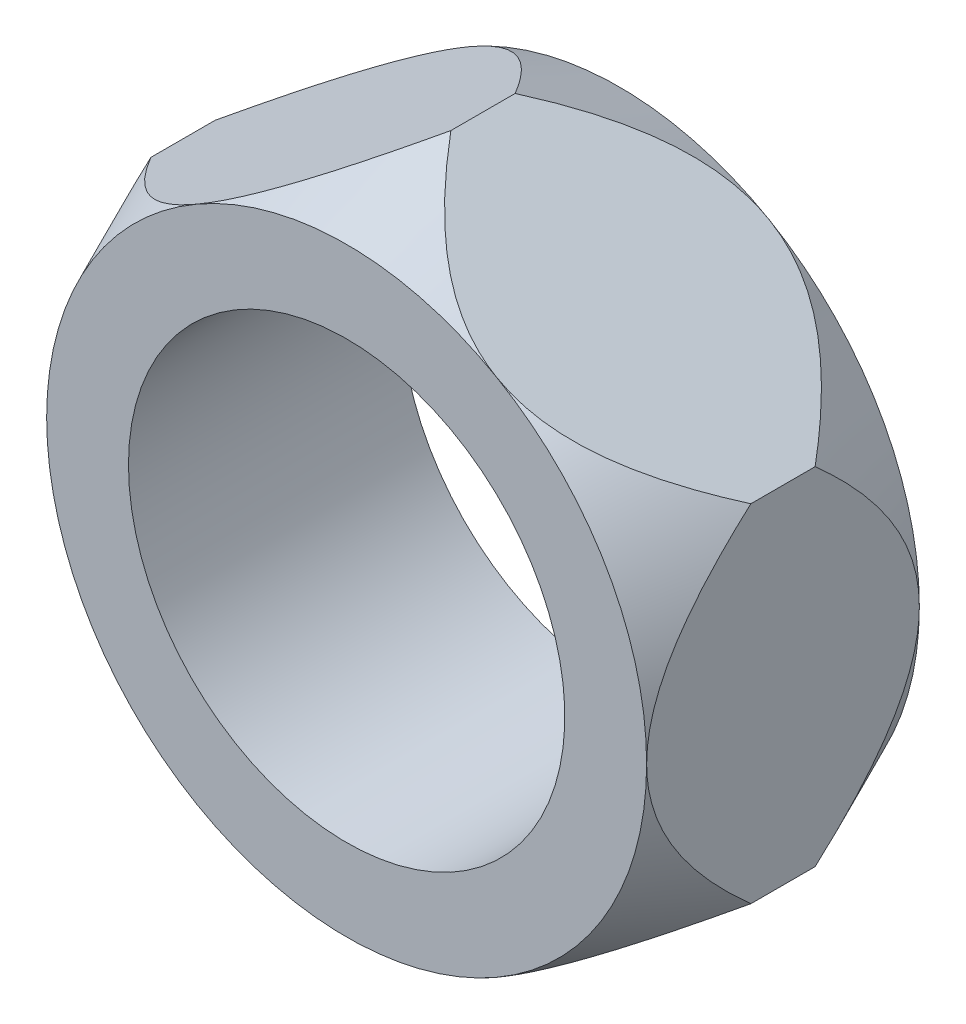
from build123d import *

# Parameters (mm, degrees)
BOSS_EXTRUDE1_DEPTH     = 2.5
SKETCH2_OUTSIDE_W       = 14.496
SKETCH2_OUTSIDE_H       = 15.346
SKETCH2_OUTSIDE_R       = 2.75
CUT_EXTRUDE1_DEPTH      = 5.888336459
CUT_EXTRUDE1_DRAFT      = -24
MIRROR1_COPY_1_SKETCH_W = 14.496
MIRROR1_COPY_1_SKETCH_H = 15.346
MIRROR1_COPY_1_SKETCH_R = 2.75
MIRROR1_COPY_1_DEPTH    = 5.888336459
MIRROR1_COPY_1_DRAFT    = -24
SKETCH3_R               = 2
CUT_EXTRUDE2_DEPTH      = 2.5


with BuildPart() as part:
    # Sketch1 → Boss-Extrude1 (new body)
    with BuildSketch(Plane.XY):
        Polygon((0, 3.175426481), (-2.75, 1.58771324), (-2.75, -1.58771324), (0, -3.175426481), (2.75, -1.58771324), (2.75, 1.58771324), align=None)
    extrude(amount=BOSS_EXTRUDE1_DEPTH)


with BuildPart() as cut_extrude1_tool:
    # Sketch2 outside → Cut-Extrude1 (with draft: the straight prism first)
    with BuildSketch(Plane(origin=(0, 0, 0), x_dir=(-1, 0, 0), z_dir=(0, 0, -1))):
        Rectangle(SKETCH2_OUTSIDE_W, SKETCH2_OUTSIDE_H)
        Circle(SKETCH2_OUTSIDE_R, mode=Mode.SUBTRACT)
    extrude(amount=-CUT_EXTRUDE1_DEPTH)
    # Cut-Extrude1: the draft: its side faces are tilted about the plane it starts from
    cut_extrude1_sides = [cut_extrude1_tool.faces().sort_by_distance(p)[0] for p in [
        (0, -7.673, 2.944168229),
        (-7.248, 0, 2.944168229),
        (0, 7.673, 2.944168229),
        (7.248, 0, 2.944168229),
        (2.75, 0, 2.944168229),
    ]]
    draft(cut_extrude1_sides, Plane(origin=(0, 0, 0), x_dir=(-1, 0, 0), z_dir=(0, 0, -1)), CUT_EXTRUDE1_DRAFT)


with BuildPart() as part_1:
    add(part.part)

    # Cut-Extrude1: cut by cut_extrude1_tool
    add(cut_extrude1_tool.part, mode=Mode.SUBTRACT)


with BuildPart() as mirror1_copy_1_tool:
    # Mirror1 copy 1 sketch → Mirror1 copy 1 (with draft: the straight prism first)
    with BuildSketch(Plane(origin=(0, 0, 2.5), x_dir=(-1, 0, 0), z_dir=(0, 0, 1))):
        Rectangle(MIRROR1_COPY_1_SKETCH_W, MIRROR1_COPY_1_SKETCH_H)
        Circle(MIRROR1_COPY_1_SKETCH_R, mode=Mode.SUBTRACT)
    extrude(amount=-MIRROR1_COPY_1_DEPTH)
    # Mirror1 copy 1: the draft: its side faces are tilted about the plane it starts from
    mirror1_copy_1_sides = [mirror1_copy_1_tool.faces().sort_by_distance(p)[0] for p in [
        (0, -7.673, -0.444168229),
        (-7.248, 0, -0.444168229),
        (0, 7.673, -0.444168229),
        (7.248, 0, -0.444168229),
        (2.75, 0, -0.444168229),
    ]]
    draft(mirror1_copy_1_sides, Plane(origin=(0, 0, 2.5), x_dir=(-1, 0, 0), z_dir=(0, 0, 1)), MIRROR1_COPY_1_DRAFT)


with BuildPart() as part_2:
    add(part_1.part)

    # Mirror1 copy 1: cut by mirror1_copy_1_tool
    add(mirror1_copy_1_tool.part, mode=Mode.SUBTRACT)

    # Sketch3 → Cut-Extrude2 (cut)
    with BuildSketch(Plane(origin=(0, 0, 0), x_dir=(-1, 0, 0), z_dir=(0, 0, -1))):
        Circle(SKETCH3_R)
    extrude(amount=-CUT_EXTRUDE2_DEPTH, mode=Mode.SUBTRACT)


solid = part_2.part
